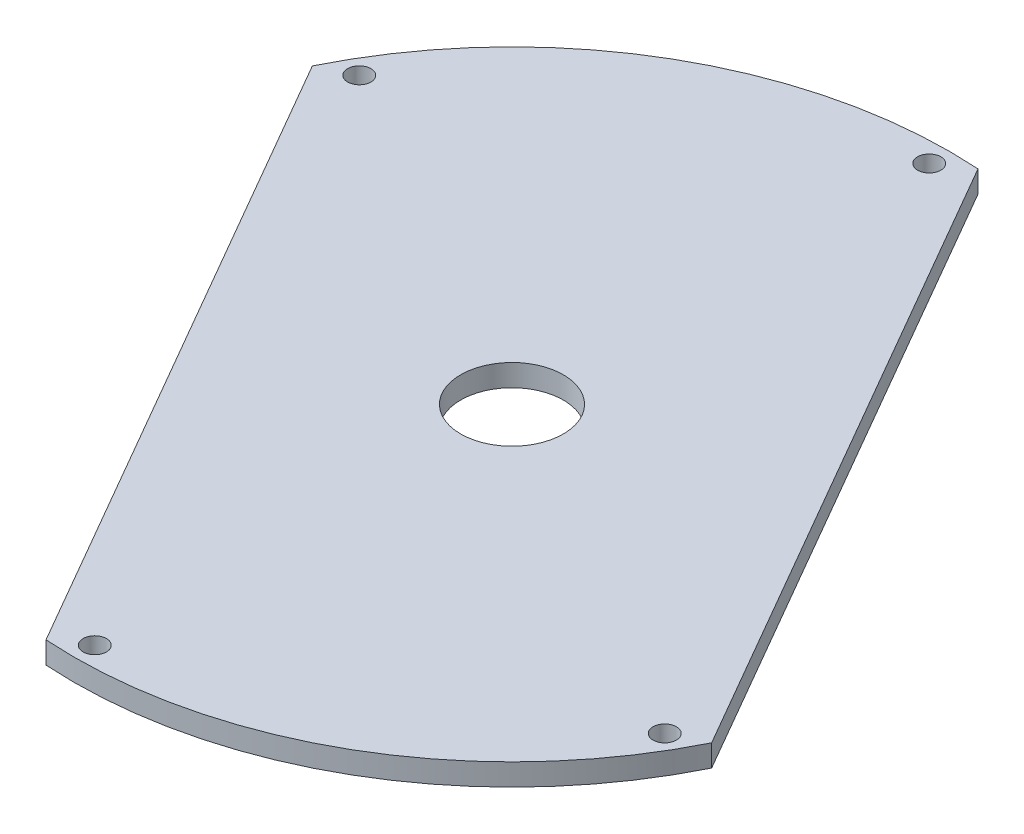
from build123d import *

# Parameters (mm, degrees)
SKETCH1_R                 = 127
EXTRUDE1_DEPTH            = 6.35
F_1_1_4_12_TAPPED_HOLE2_D = 29.76626
F_1_4_CLEARANCE_HOLE1_D   = 6.7564
CIRPATTERN1_COUNT         = 6
CUT_EXTRUDE2_DEPTH        = 180.717340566


with BuildPart() as part:
    # Sketch1 → Extrude1 (new body)
    with BuildSketch(Plane(origin=(0, 0, 0), x_dir=(1, 0, 0), z_dir=(0, 1, 0))):
        with Locations(Location((0, 0, 0), (0, 0, 270))):
            Circle(SKETCH1_R)
    extrude(amount=EXTRUDE1_DEPTH)

    # 1-1_4-12 Tapped Hole2 (through all)
    with Locations(Plane.ZX.offset(6.35)):
        with Locations((0, 0)):
            Hole(F_1_1_4_12_TAPPED_HOLE2_D / 2)

    # 1_4 Clearance Hole1 (through all)
    with Locations(Plane(origin=(0, 6.35, 121.0056), x_dir=(0, 0, 1), z_dir=(0, 1, 0))):
        with Locations((0, 0)):
            f_1_4_clearance_hole1 = Hole(F_1_4_CLEARANCE_HOLE1_D / 2)

    # CirPattern1: 1_4 Clearance Hole1 ×6 about axis, 2 skipped
    cirpattern1_axis = Axis((0, 6.35, 0), (0, -1, 0))
    add([f_1_4_clearance_hole1.rotate(cirpattern1_axis, i * 360 / CIRPATTERN1_COUNT) for i in range(1, CIRPATTERN1_COUNT) if i not in (1, 4)], mode=Mode.SUBTRACT)

    # Sketch4 → Cut-Extrude2 (cut, through all)
    with BuildSketch(Plane(origin=(0, 6.35, 0), x_dir=(-1, 0, 0), z_dir=(0, 1, 0))):
        with BuildLine():
            Line((128.017593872, -80.40737685), (1.177664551, 139.285825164))
            ThreePointArc((1.177664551, 139.285825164), (131.9325732, 68.315072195), (128.017593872, -80.40737685))
        make_face()
        with BuildLine():
            Line((5.626034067, -151.07017685), (-121.213895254, 68.623025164))
            ThreePointArc((-121.213895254, 68.623025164), (-125.128874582, -80.099423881), (5.626034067, -151.07017685))
        make_face()
    extrude(amount=-CUT_EXTRUDE2_DEPTH, mode=Mode.SUBTRACT)


solid = part.part
